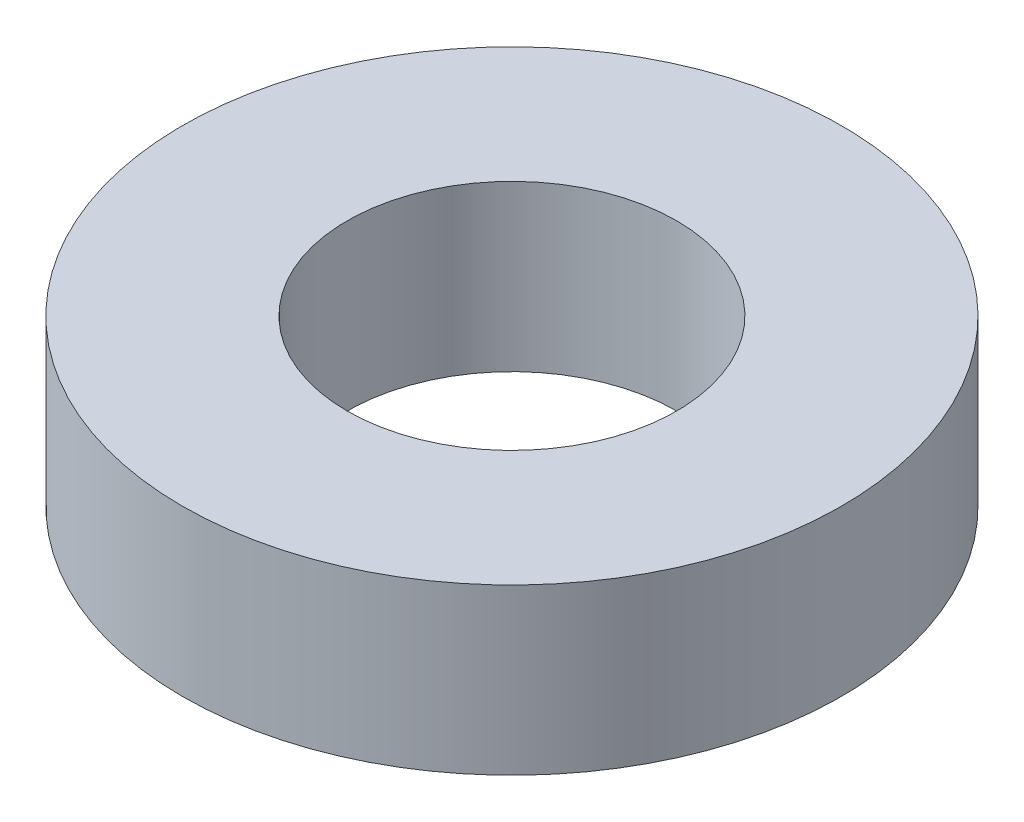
from build123d import *

# Parameters (mm, degrees)
SKETCH_1_R      = 10
SKETCH_1_R_2    = 5
EXTRUDE_1_DEPTH = 5


with BuildPart() as part:
    # Sketch 1 → Extrude 1 (new body)
    with BuildSketch(Plane(origin=(0, 0, 0), x_dir=(1, 0, 0), z_dir=(0, 1, 0))):
        with Locations(Location((0, 0, 0), (0, 0, 270))):
            Circle(SKETCH_1_R)
        with Locations(Location((0, 0, 0), (0, 0, 270))):
            Circle(SKETCH_1_R_2, mode=Mode.SUBTRACT)
    extrude(amount=EXTRUDE_1_DEPTH)


solid = part.part
